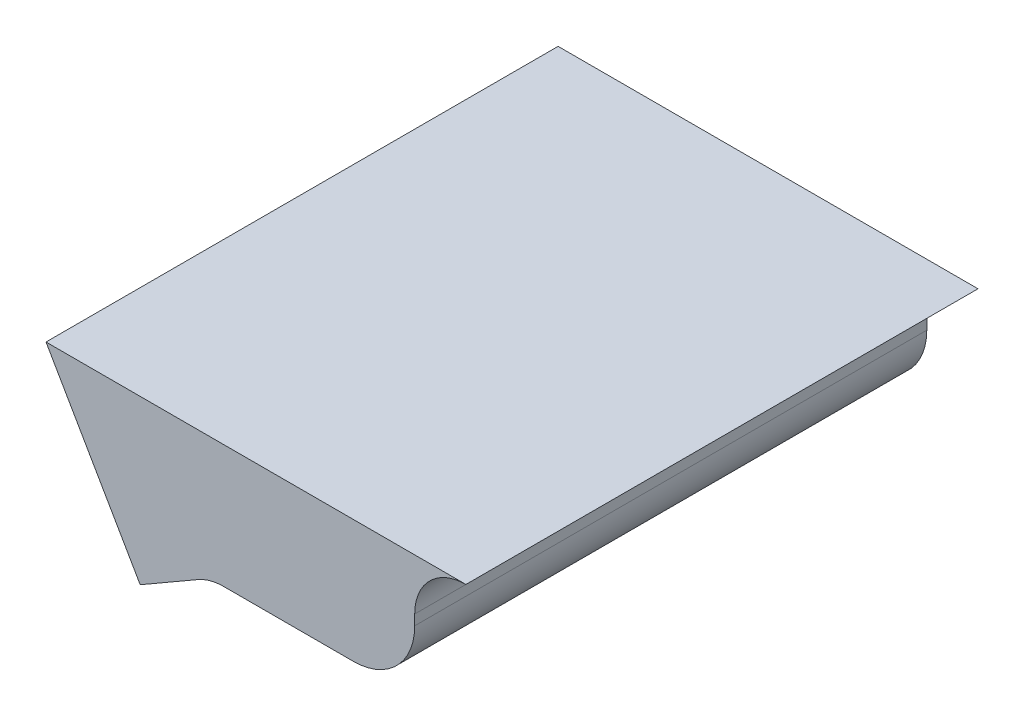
ISO-10303-21;
HEADER;
FILE_DESCRIPTION(('STEP AP214'),'2;1');
FILE_NAME('part.step','',(''),(''),'','','');
FILE_SCHEMA(('AUTOMOTIVE_DESIGN { 1 0 10303 214 1 1 1 1 }'));
ENDSEC;
DATA;
#1=APPLICATION_CONTEXT('core data for automotive mechanical design processes');
#2=APPLICATION_PROTOCOL_DEFINITION('international standard','automotive_design',2000,#1);
#3=PRODUCT_CONTEXT('',#1,'mechanical');
#4=PRODUCT('Part','Part','',(#3));
#5=PRODUCT_RELATED_PRODUCT_CATEGORY('part','',(#4));
#6=PRODUCT_DEFINITION_FORMATION('','',#4);
#7=PRODUCT_DEFINITION_CONTEXT('part definition',#1,'design');
#8=PRODUCT_DEFINITION('design','',#6,#7);
#9=PRODUCT_DEFINITION_SHAPE('','',#8);
#10=(LENGTH_UNIT() NAMED_UNIT(*) SI_UNIT(.MILLI.,.METRE.));
#11=(NAMED_UNIT(*) PLANE_ANGLE_UNIT() SI_UNIT($,.RADIAN.));
#12=(NAMED_UNIT(*) SI_UNIT($,.STERADIAN.) SOLID_ANGLE_UNIT());
#13=UNCERTAINTY_MEASURE_WITH_UNIT(LENGTH_MEASURE(1.E-05),#10,'distance_accuracy_value','');
#14=(GEOMETRIC_REPRESENTATION_CONTEXT(3) GLOBAL_UNCERTAINTY_ASSIGNED_CONTEXT((#13)) GLOBAL_UNIT_ASSIGNED_CONTEXT((#10,
#11,#12)) REPRESENTATION_CONTEXT('',''));
#15=CARTESIAN_POINT('',(0.,0.,0.));
#16=DIRECTION('',(0.,0.,1.));
#17=DIRECTION('',(1.,0.,0.));
#18=AXIS2_PLACEMENT_3D('',#15,#16,#17);
#19=CARTESIAN_POINT('',(9.,0.,12.5));
#20=DIRECTION('',(1.,0.,0.));
#21=DIRECTION('',(0.,0.,-1.));
#22=AXIS2_PLACEMENT_3D('',#19,#20,#21);
#23=PLANE('',#22);
#24=DIRECTION('',(0.,-1.,0.));
#25=VECTOR('',#24,1.);
#26=CARTESIAN_POINT('',(9.,0.,12.5));
#27=LINE('',#26,#25);
#28=CARTESIAN_POINT('',(9.,-2.5,12.5));
#29=VERTEX_POINT('',#28);
#30=CARTESIAN_POINT('',(9.,-3.,12.5));
#31=VERTEX_POINT('',#30);
#32=EDGE_CURVE('E117',#29,#31,#27,.T.);
#33=ORIENTED_EDGE('',*,*,#32,.T.);
#34=DIRECTION('',(0.,0.,-1.));
#35=VECTOR('',#34,1.);
#36=CARTESIAN_POINT('',(9.,-3.,12.5));
#37=LINE('',#36,#35);
#38=CARTESIAN_POINT('',(9.,-3.,-12.5));
#39=VERTEX_POINT('',#38);
#40=EDGE_CURVE('E134',#31,#39,#37,.T.);
#41=ORIENTED_EDGE('',*,*,#40,.T.);
#42=DIRECTION('',(0.,-1.,0.));
#43=VECTOR('',#42,1.);
#44=CARTESIAN_POINT('',(9.,0.,-12.5));
#45=LINE('',#44,#43);
#46=CARTESIAN_POINT('',(9.,-2.5,-12.5));
#47=VERTEX_POINT('',#46);
#48=EDGE_CURVE('E140',#47,#39,#45,.T.);
#49=ORIENTED_EDGE('',*,*,#48,.F.);
#50=DIRECTION('',(0.,0.,-1.));
#51=VECTOR('',#50,1.);
#52=CARTESIAN_POINT('',(9.,-2.5,12.5));
#53=LINE('',#52,#51);
#54=EDGE_CURVE('E108',#47,#29,#53,.F.);
#55=ORIENTED_EDGE('',*,*,#54,.T.);
#56=EDGE_LOOP('',(#33,#41,#49,#55));
#57=FACE_BOUND('',#56,.T.);
#58=ADVANCED_FACE('F36',(#57),#23,.T.);
#59=CARTESIAN_POINT('',(-9.,0.,12.5));
#60=DIRECTION('',(0.866025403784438,0.500000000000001,0.));
#61=DIRECTION('',(-0.500000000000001,0.866025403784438,0.));
#62=AXIS2_PLACEMENT_3D('',#59,#60,#61);
#63=PLANE('',#62);
#64=DIRECTION('',(0.500000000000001,-0.866025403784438,0.));
#65=VECTOR('',#64,1.);
#66=CARTESIAN_POINT('',(-9.,0.,-12.5));
#67=LINE('',#66,#65);
#68=CARTESIAN_POINT('',(-9.,0.,-12.5));
#69=VERTEX_POINT('',#68);
#70=CARTESIAN_POINT('',(-4.40192378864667,-7.96410161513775,-12.5));
#71=VERTEX_POINT('',#70);
#72=EDGE_CURVE('E116',#69,#71,#67,.T.);
#73=ORIENTED_EDGE('',*,*,#72,.T.);
#74=DIRECTION('',(0.,0.,-1.));
#75=VECTOR('',#74,1.);
#76=CARTESIAN_POINT('',(-4.40192378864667,-7.96410161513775,12.5));
#77=LINE('',#76,#75);
#78=CARTESIAN_POINT('',(-4.40192378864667,-7.96410161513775,12.5));
#79=VERTEX_POINT('',#78);
#80=EDGE_CURVE('E160',#79,#71,#77,.T.);
#81=ORIENTED_EDGE('',*,*,#80,.F.);
#82=DIRECTION('',(0.500000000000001,-0.866025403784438,0.));
#83=VECTOR('',#82,1.);
#84=CARTESIAN_POINT('',(-9.,0.,12.5));
#85=LINE('',#84,#83);
#86=CARTESIAN_POINT('',(-9.,0.,12.5));
#87=VERTEX_POINT('',#86);
#88=EDGE_CURVE('E156',#87,#79,#85,.T.);
#89=ORIENTED_EDGE('',*,*,#88,.F.);
#90=DIRECTION('',(0.,0.,-1.));
#91=VECTOR('',#90,1.);
#92=CARTESIAN_POINT('',(-9.,0.,12.5));
#93=LINE('',#92,#91);
#94=EDGE_CURVE('E109',#87,#69,#93,.T.);
#95=ORIENTED_EDGE('',*,*,#94,.T.);
#96=EDGE_LOOP('',(#73,#81,#89,#95));
#97=FACE_BOUND('',#96,.T.);
#98=ADVANCED_FACE('F179',(#97),#63,.F.);
#99=CARTESIAN_POINT('',(-0.999999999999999,-6.,12.5));
#100=DIRECTION('',(0.500000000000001,-0.866025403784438,0.));
#101=DIRECTION('',(0.866025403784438,0.500000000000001,0.));
#102=AXIS2_PLACEMENT_3D('',#99,#100,#101);
#103=PLANE('',#102);
#104=DIRECTION('',(-0.866025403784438,-0.500000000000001,0.));
#105=VECTOR('',#104,1.);
#106=CARTESIAN_POINT('',(-0.999999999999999,-6.,-12.5));
#107=LINE('',#106,#105);
#108=CARTESIAN_POINT('',(-1.58012701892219,-6.3349364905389,-12.5));
#109=VERTEX_POINT('',#108);
#110=EDGE_CURVE('E146',#109,#71,#107,.T.);
#111=ORIENTED_EDGE('',*,*,#110,.F.);
#112=DIRECTION('',(0.,0.,-1.));
#113=VECTOR('',#112,1.);
#114=CARTESIAN_POINT('',(-1.58012701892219,-6.3349364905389,12.5));
#115=LINE('',#114,#113);
#116=CARTESIAN_POINT('',(-1.58012701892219,-6.3349364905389,12.5));
#117=VERTEX_POINT('',#116);
#118=EDGE_CURVE('E122',#109,#117,#115,.F.);
#119=ORIENTED_EDGE('',*,*,#118,.T.);
#120=DIRECTION('',(-0.866025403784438,-0.500000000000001,0.));
#121=VECTOR('',#120,1.);
#122=CARTESIAN_POINT('',(-0.999999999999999,-6.,12.5));
#123=LINE('',#122,#121);
#124=EDGE_CURVE('E154',#117,#79,#123,.T.);
#125=ORIENTED_EDGE('',*,*,#124,.T.);
#126=ORIENTED_EDGE('',*,*,#80,.T.);
#127=EDGE_LOOP('',(#111,#119,#125,#126));
#128=FACE_BOUND('',#127,.T.);
#129=ADVANCED_FACE('F174',(#128),#103,.T.);
#130=CARTESIAN_POINT('',(9.,-6.,12.5));
#131=DIRECTION('',(0.,-1.,0.));
#132=DIRECTION('',(1.,0.,0.));
#133=AXIS2_PLACEMENT_3D('',#130,#131,#132);
#134=PLANE('',#133);
#135=DIRECTION('',(-1.,0.,0.));
#136=VECTOR('',#135,1.);
#137=CARTESIAN_POINT('',(9.,-6.,-12.5));
#138=LINE('',#137,#136);
#139=CARTESIAN_POINT('',(6.,-6.,-12.5));
#140=VERTEX_POINT('',#139);
#141=CARTESIAN_POINT('',(-0.33012701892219,-6.,-12.5));
#142=VERTEX_POINT('',#141);
#143=EDGE_CURVE('E144',#140,#142,#138,.T.);
#144=ORIENTED_EDGE('',*,*,#143,.F.);
#145=DIRECTION('',(0.,0.,-1.));
#146=VECTOR('',#145,1.);
#147=CARTESIAN_POINT('',(6.,-6.,12.5));
#148=LINE('',#147,#146);
#149=CARTESIAN_POINT('',(6.,-6.,12.5));
#150=VERTEX_POINT('',#149);
#151=EDGE_CURVE('E43',#140,#150,#148,.F.);
#152=ORIENTED_EDGE('',*,*,#151,.T.);
#153=DIRECTION('',(-1.,0.,0.));
#154=VECTOR('',#153,1.);
#155=CARTESIAN_POINT('',(9.,-6.,12.5));
#156=LINE('',#155,#154);
#157=CARTESIAN_POINT('',(-0.33012701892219,-6.,12.5));
#158=VERTEX_POINT('',#157);
#159=EDGE_CURVE('E152',#150,#158,#156,.T.);
#160=ORIENTED_EDGE('',*,*,#159,.T.);
#161=DIRECTION('',(0.,0.,-1.));
#162=VECTOR('',#161,1.);
#163=CARTESIAN_POINT('',(-0.330127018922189,-6.,-12.5));
#164=LINE('',#163,#162);
#165=EDGE_CURVE('E126',#158,#142,#164,.T.);
#166=ORIENTED_EDGE('',*,*,#165,.T.);
#167=EDGE_LOOP('',(#144,#152,#160,#166));
#168=FACE_BOUND('',#167,.T.);
#169=ADVANCED_FACE('F166',(#168),#134,.T.);
#170=CARTESIAN_POINT('',(9.,0.,12.5));
#171=DIRECTION('',(0.,0.,-1.));
#172=DIRECTION('',(-1.,0.,0.));
#173=AXIS2_PLACEMENT_3D('',#170,#171,#172);
#174=PLANE('',#173);
#175=ORIENTED_EDGE('',*,*,#159,.F.);
#176=CARTESIAN_POINT('',(6.,-3.,12.5));
#177=DIRECTION('',(0.,0.,-1.));
#178=DIRECTION('',(-1.,0.,0.));
#179=AXIS2_PLACEMENT_3D('',#176,#177,#178);
#180=CIRCLE('',#179,3.);
#181=EDGE_CURVE('E11',#150,#31,#180,.F.);
#182=ORIENTED_EDGE('',*,*,#181,.T.);
#183=ORIENTED_EDGE('',*,*,#32,.F.);
#184=CARTESIAN_POINT('',(11.5,-2.5,12.5));
#185=DIRECTION('',(0.,0.,-1.));
#186=DIRECTION('',(-1.,0.,0.));
#187=AXIS2_PLACEMENT_3D('',#184,#185,#186);
#188=CIRCLE('',#187,2.5);
#189=CARTESIAN_POINT('',(11.5,0.,12.5));
#190=VERTEX_POINT('',#189);
#191=EDGE_CURVE('E121',#29,#190,#188,.T.);
#192=ORIENTED_EDGE('',*,*,#191,.T.);
#193=DIRECTION('',(-1.,0.,0.));
#194=VECTOR('',#193,1.);
#195=CARTESIAN_POINT('',(9.,0.,12.5));
#196=LINE('',#195,#194);
#197=EDGE_CURVE('E103',#190,#87,#196,.T.);
#198=ORIENTED_EDGE('',*,*,#197,.T.);
#199=ORIENTED_EDGE('',*,*,#88,.T.);
#200=ORIENTED_EDGE('',*,*,#124,.F.);
#201=CARTESIAN_POINT('',(-0.33012701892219,-8.5,12.5));
#202=DIRECTION('',(0.,0.,-1.));
#203=DIRECTION('',(-1.,0.,0.));
#204=AXIS2_PLACEMENT_3D('',#201,#202,#203);
#205=CIRCLE('',#204,2.5);
#206=EDGE_CURVE('E131',#117,#158,#205,.T.);
#207=ORIENTED_EDGE('',*,*,#206,.T.);
#208=EDGE_LOOP('',(#175,#182,#183,#192,#198,#199,#200,#207));
#209=FACE_BOUND('',#208,.T.);
#210=ADVANCED_FACE('F181',(#209),#174,.F.);
#211=CARTESIAN_POINT('',(9.,0.,-12.5));
#212=DIRECTION('',(0.,0.,-1.));
#213=DIRECTION('',(-1.,0.,0.));
#214=AXIS2_PLACEMENT_3D('',#211,#212,#213);
#215=PLANE('',#214);
#216=ORIENTED_EDGE('',*,*,#48,.T.);
#217=CARTESIAN_POINT('',(6.,-3.,-12.5));
#218=DIRECTION('',(0.,0.,-1.));
#219=DIRECTION('',(-1.,0.,0.));
#220=AXIS2_PLACEMENT_3D('',#217,#218,#219);
#221=CIRCLE('',#220,3.);
#222=EDGE_CURVE('E57',#39,#140,#221,.T.);
#223=ORIENTED_EDGE('',*,*,#222,.T.);
#224=ORIENTED_EDGE('',*,*,#143,.T.);
#225=CARTESIAN_POINT('',(-0.33012701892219,-8.5,-12.5));
#226=DIRECTION('',(0.,0.,-1.));
#227=DIRECTION('',(-1.,0.,0.));
#228=AXIS2_PLACEMENT_3D('',#225,#226,#227);
#229=CIRCLE('',#228,2.5);
#230=EDGE_CURVE('E124',#142,#109,#229,.F.);
#231=ORIENTED_EDGE('',*,*,#230,.T.);
#232=ORIENTED_EDGE('',*,*,#110,.T.);
#233=ORIENTED_EDGE('',*,*,#72,.F.);
#234=DIRECTION('',(-1.,0.,0.));
#235=VECTOR('',#234,1.);
#236=CARTESIAN_POINT('',(9.,0.,-12.5));
#237=LINE('',#236,#235);
#238=CARTESIAN_POINT('',(11.5,0.,-12.5));
#239=VERTEX_POINT('',#238);
#240=EDGE_CURVE('E100',#239,#69,#237,.T.);
#241=ORIENTED_EDGE('',*,*,#240,.F.);
#242=CARTESIAN_POINT('',(11.5,-2.5,-12.5));
#243=DIRECTION('',(0.,0.,-1.));
#244=DIRECTION('',(-1.,0.,0.));
#245=AXIS2_PLACEMENT_3D('',#242,#243,#244);
#246=CIRCLE('',#245,2.5);
#247=EDGE_CURVE('E113',#239,#47,#246,.F.);
#248=ORIENTED_EDGE('',*,*,#247,.T.);
#249=EDGE_LOOP('',(#216,#223,#224,#231,#232,#233,#241,#248));
#250=FACE_BOUND('',#249,.T.);
#251=ADVANCED_FACE('F112',(#250),#215,.T.);
#252=CARTESIAN_POINT('',(11.5,-2.5,25.));
#253=DIRECTION('',(0.,0.,1.));
#254=DIRECTION('',(1.,0.,0.));
#255=AXIS2_PLACEMENT_3D('',#252,#253,#254);
#256=CYLINDRICAL_SURFACE('',#255,2.5);
#257=ORIENTED_EDGE('',*,*,#191,.F.);
#258=ORIENTED_EDGE('',*,*,#54,.F.);
#259=ORIENTED_EDGE('',*,*,#247,.F.);
#260=DIRECTION('',(0.,0.,-1.));
#261=VECTOR('',#260,1.);
#262=CARTESIAN_POINT('',(11.5,0.,-12.5));
#263=LINE('',#262,#261);
#264=EDGE_CURVE('E97',#190,#239,#263,.T.);
#265=ORIENTED_EDGE('',*,*,#264,.F.);
#266=EDGE_LOOP('',(#257,#258,#259,#265));
#267=FACE_BOUND('',#266,.T.);
#268=ADVANCED_FACE('F120',(#267),#256,.F.);
#269=CARTESIAN_POINT('',(-0.33012701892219,-8.5,12.5));
#270=DIRECTION('',(0.,0.,1.));
#271=DIRECTION('',(1.,0.,0.));
#272=AXIS2_PLACEMENT_3D('',#269,#270,#271);
#273=CYLINDRICAL_SURFACE('',#272,2.5);
#274=ORIENTED_EDGE('',*,*,#206,.F.);
#275=ORIENTED_EDGE('',*,*,#118,.F.);
#276=ORIENTED_EDGE('',*,*,#230,.F.);
#277=ORIENTED_EDGE('',*,*,#165,.F.);
#278=EDGE_LOOP('',(#274,#275,#276,#277));
#279=FACE_BOUND('',#278,.T.);
#280=ADVANCED_FACE('F170',(#279),#273,.F.);
#281=CARTESIAN_POINT('',(6.,-3.,12.5));
#282=DIRECTION('',(0.,0.,-1.));
#283=DIRECTION('',(-1.,0.,0.));
#284=AXIS2_PLACEMENT_3D('',#281,#282,#283);
#285=CYLINDRICAL_SURFACE('',#284,3.);
#286=ORIENTED_EDGE('',*,*,#181,.F.);
#287=ORIENTED_EDGE('',*,*,#151,.F.);
#288=ORIENTED_EDGE('',*,*,#222,.F.);
#289=ORIENTED_EDGE('',*,*,#40,.F.);
#290=EDGE_LOOP('',(#286,#287,#288,#289));
#291=FACE_BOUND('',#290,.T.);
#292=ADVANCED_FACE('F182',(#291),#285,.T.);
#293=CARTESIAN_POINT('',(-25.,0.,25.));
#294=DIRECTION('',(0.,-1.,0.));
#295=DIRECTION('',(0.,0.,-1.));
#296=AXIS2_PLACEMENT_3D('',#293,#294,#295);
#297=PLANE('',#296);
#298=ORIENTED_EDGE('',*,*,#197,.F.);
#299=ORIENTED_EDGE('',*,*,#264,.T.);
#300=ORIENTED_EDGE('',*,*,#240,.T.);
#301=ORIENTED_EDGE('',*,*,#94,.F.);
#302=EDGE_LOOP('',(#298,#299,#300,#301));
#303=FACE_BOUND('',#302,.T.);
#304=ADVANCED_FACE('F99',(#303),#297,.F.);
#305=CLOSED_SHELL('',(#58,#98,#129,#169,#210,#251,#268,#280,#292,#304));
#306=MANIFOLD_SOLID_BREP('B2',#305);
#307=ADVANCED_BREP_SHAPE_REPRESENTATION('',(#18,#306),#14);
#308=SHAPE_DEFINITION_REPRESENTATION(#9,#307);
ENDSEC;
END-ISO-10303-21;
